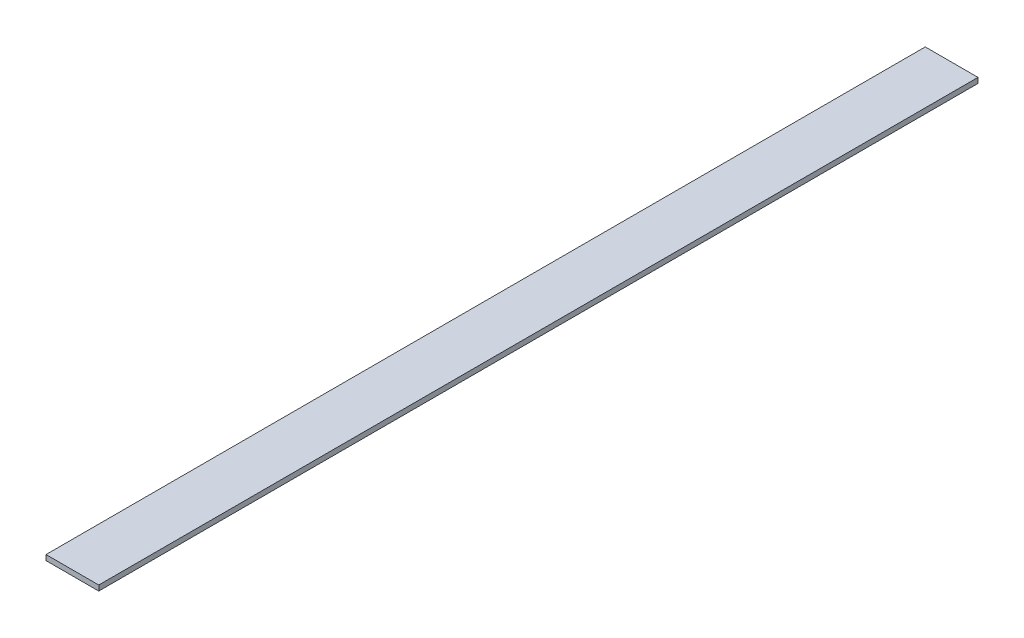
ISO-10303-21;
HEADER;
FILE_DESCRIPTION(('STEP AP214'),'2;1');
FILE_NAME('part.step','',(''),(''),'','','');
FILE_SCHEMA(('AUTOMOTIVE_DESIGN { 1 0 10303 214 1 1 1 1 }'));
ENDSEC;
DATA;
#1=APPLICATION_CONTEXT('core data for automotive mechanical design processes');
#2=APPLICATION_PROTOCOL_DEFINITION('international standard','automotive_design',2000,#1);
#3=PRODUCT_CONTEXT('',#1,'mechanical');
#4=PRODUCT('Part','Part','',(#3));
#5=PRODUCT_RELATED_PRODUCT_CATEGORY('part','',(#4));
#6=PRODUCT_DEFINITION_FORMATION('','',#4);
#7=PRODUCT_DEFINITION_CONTEXT('part definition',#1,'design');
#8=PRODUCT_DEFINITION('design','',#6,#7);
#9=PRODUCT_DEFINITION_SHAPE('','',#8);
#10=(LENGTH_UNIT() NAMED_UNIT(*) SI_UNIT(.MILLI.,.METRE.));
#11=(NAMED_UNIT(*) PLANE_ANGLE_UNIT() SI_UNIT($,.RADIAN.));
#12=(NAMED_UNIT(*) SI_UNIT($,.STERADIAN.) SOLID_ANGLE_UNIT());
#13=UNCERTAINTY_MEASURE_WITH_UNIT(LENGTH_MEASURE(1.E-05),#10,'distance_accuracy_value','');
#14=(GEOMETRIC_REPRESENTATION_CONTEXT(3) GLOBAL_UNCERTAINTY_ASSIGNED_CONTEXT((#13)) GLOBAL_UNIT_ASSIGNED_CONTEXT((#10,
#11,#12)) REPRESENTATION_CONTEXT('',''));
#15=CARTESIAN_POINT('',(0.,0.,0.));
#16=DIRECTION('',(0.,0.,1.));
#17=DIRECTION('',(1.,0.,0.));
#18=AXIS2_PLACEMENT_3D('',#15,#16,#17);
#19=CARTESIAN_POINT('',(15.,0.,0.));
#20=DIRECTION('',(-1.,0.,0.));
#21=DIRECTION('',(0.,0.,1.));
#22=AXIS2_PLACEMENT_3D('',#19,#20,#21);
#23=PLANE('',#22);
#24=DIRECTION('',(0.,-1.,0.));
#25=VECTOR('',#24,1.);
#26=CARTESIAN_POINT('',(15.,1.5,0.));
#27=LINE('',#26,#25);
#28=CARTESIAN_POINT('',(15.,3.,0.));
#29=VERTEX_POINT('',#28);
#30=CARTESIAN_POINT('',(15.,0.,0.));
#31=VERTEX_POINT('',#30);
#32=EDGE_CURVE('E51',#29,#31,#27,.T.);
#33=ORIENTED_EDGE('',*,*,#32,.F.);
#34=DIRECTION('',(0.,0.,-1.));
#35=VECTOR('',#34,1.);
#36=CARTESIAN_POINT('',(15.,3.,250.));
#37=LINE('',#36,#35);
#38=CARTESIAN_POINT('',(15.,3.,500.));
#39=VERTEX_POINT('',#38);
#40=EDGE_CURVE('E66',#39,#29,#37,.T.);
#41=ORIENTED_EDGE('',*,*,#40,.F.);
#42=DIRECTION('',(0.,-1.,0.));
#43=VECTOR('',#42,1.);
#44=CARTESIAN_POINT('',(15.,1.5,500.));
#45=LINE('',#44,#43);
#46=CARTESIAN_POINT('',(15.,0.,500.));
#47=VERTEX_POINT('',#46);
#48=EDGE_CURVE('E18',#39,#47,#45,.T.);
#49=ORIENTED_EDGE('',*,*,#48,.T.);
#50=DIRECTION('',(0.,0.,1.));
#51=VECTOR('',#50,1.);
#52=CARTESIAN_POINT('',(15.,0.,250.));
#53=LINE('',#52,#51);
#54=EDGE_CURVE('E56',#31,#47,#53,.T.);
#55=ORIENTED_EDGE('',*,*,#54,.F.);
#56=EDGE_LOOP('',(#33,#41,#49,#55));
#57=FACE_BOUND('',#56,.T.);
#58=ADVANCED_FACE('F14',(#57),#23,.F.);
#59=CARTESIAN_POINT('',(15.,0.,500.));
#60=DIRECTION('',(0.,0.,-1.));
#61=DIRECTION('',(-1.,0.,0.));
#62=AXIS2_PLACEMENT_3D('',#59,#60,#61);
#63=PLANE('',#62);
#64=DIRECTION('',(-1.,0.,0.));
#65=VECTOR('',#64,1.);
#66=CARTESIAN_POINT('',(0.,0.,500.));
#67=LINE('',#66,#65);
#68=CARTESIAN_POINT('',(-15.,0.,500.));
#69=VERTEX_POINT('',#68);
#70=EDGE_CURVE('E61',#47,#69,#67,.T.);
#71=ORIENTED_EDGE('',*,*,#70,.F.);
#72=ORIENTED_EDGE('',*,*,#48,.F.);
#73=DIRECTION('',(1.,0.,0.));
#74=VECTOR('',#73,1.);
#75=CARTESIAN_POINT('',(0.,3.,500.));
#76=LINE('',#75,#74);
#77=CARTESIAN_POINT('',(-15.,3.,500.));
#78=VERTEX_POINT('',#77);
#79=EDGE_CURVE('E79',#78,#39,#76,.T.);
#80=ORIENTED_EDGE('',*,*,#79,.F.);
#81=DIRECTION('',(0.,-1.,0.));
#82=VECTOR('',#81,1.);
#83=CARTESIAN_POINT('',(-15.,1.5,500.));
#84=LINE('',#83,#82);
#85=EDGE_CURVE('E72',#78,#69,#84,.T.);
#86=ORIENTED_EDGE('',*,*,#85,.T.);
#87=EDGE_LOOP('',(#71,#72,#80,#86));
#88=FACE_BOUND('',#87,.T.);
#89=ADVANCED_FACE('F71',(#88),#63,.F.);
#90=CARTESIAN_POINT('',(-15.,0.,500.));
#91=DIRECTION('',(0.,-1.,0.));
#92=DIRECTION('',(0.,0.,-1.));
#93=AXIS2_PLACEMENT_3D('',#90,#91,#92);
#94=PLANE('',#93);
#95=ORIENTED_EDGE('',*,*,#70,.T.);
#96=DIRECTION('',(0.,0.,-1.));
#97=VECTOR('',#96,1.);
#98=CARTESIAN_POINT('',(-15.,0.,250.));
#99=LINE('',#98,#97);
#100=CARTESIAN_POINT('',(-15.,0.,0.));
#101=VERTEX_POINT('',#100);
#102=EDGE_CURVE('E82',#69,#101,#99,.T.);
#103=ORIENTED_EDGE('',*,*,#102,.T.);
#104=DIRECTION('',(-1.,0.,0.));
#105=VECTOR('',#104,1.);
#106=CARTESIAN_POINT('',(0.,0.,0.));
#107=LINE('',#106,#105);
#108=EDGE_CURVE('E63',#31,#101,#107,.T.);
#109=ORIENTED_EDGE('',*,*,#108,.F.);
#110=ORIENTED_EDGE('',*,*,#54,.T.);
#111=EDGE_LOOP('',(#95,#103,#109,#110));
#112=FACE_BOUND('',#111,.T.);
#113=ADVANCED_FACE('F58',(#112),#94,.T.);
#114=CARTESIAN_POINT('',(15.,0.,0.));
#115=DIRECTION('',(0.,0.,-1.));
#116=DIRECTION('',(-1.,0.,0.));
#117=AXIS2_PLACEMENT_3D('',#114,#115,#116);
#118=PLANE('',#117);
#119=ORIENTED_EDGE('',*,*,#32,.T.);
#120=ORIENTED_EDGE('',*,*,#108,.T.);
#121=DIRECTION('',(0.,1.,0.));
#122=VECTOR('',#121,1.);
#123=CARTESIAN_POINT('',(-15.,1.5,0.));
#124=LINE('',#123,#122);
#125=CARTESIAN_POINT('',(-15.,3.,0.));
#126=VERTEX_POINT('',#125);
#127=EDGE_CURVE('E24',#101,#126,#124,.T.);
#128=ORIENTED_EDGE('',*,*,#127,.T.);
#129=DIRECTION('',(-1.,0.,0.));
#130=VECTOR('',#129,1.);
#131=CARTESIAN_POINT('',(0.,3.,0.));
#132=LINE('',#131,#130);
#133=EDGE_CURVE('E32',#29,#126,#132,.T.);
#134=ORIENTED_EDGE('',*,*,#133,.F.);
#135=EDGE_LOOP('',(#119,#120,#128,#134));
#136=FACE_BOUND('',#135,.T.);
#137=ADVANCED_FACE('F86',(#136),#118,.T.);
#138=CARTESIAN_POINT('',(15.,3.,0.));
#139=DIRECTION('',(0.,1.,0.));
#140=DIRECTION('',(-1.,0.,0.));
#141=AXIS2_PLACEMENT_3D('',#138,#139,#140);
#142=PLANE('',#141);
#143=DIRECTION('',(0.,0.,1.));
#144=VECTOR('',#143,1.);
#145=CARTESIAN_POINT('',(-15.,3.,250.));
#146=LINE('',#145,#144);
#147=EDGE_CURVE('E9',#126,#78,#146,.T.);
#148=ORIENTED_EDGE('',*,*,#147,.T.);
#149=ORIENTED_EDGE('',*,*,#79,.T.);
#150=ORIENTED_EDGE('',*,*,#40,.T.);
#151=ORIENTED_EDGE('',*,*,#133,.T.);
#152=EDGE_LOOP('',(#148,#149,#150,#151));
#153=FACE_BOUND('',#152,.T.);
#154=ADVANCED_FACE('F88',(#153),#142,.T.);
#155=CARTESIAN_POINT('',(-15.,0.,500.));
#156=DIRECTION('',(1.,0.,0.));
#157=DIRECTION('',(0.,0.,-1.));
#158=AXIS2_PLACEMENT_3D('',#155,#156,#157);
#159=PLANE('',#158);
#160=ORIENTED_EDGE('',*,*,#127,.F.);
#161=ORIENTED_EDGE('',*,*,#102,.F.);
#162=ORIENTED_EDGE('',*,*,#85,.F.);
#163=ORIENTED_EDGE('',*,*,#147,.F.);
#164=EDGE_LOOP('',(#160,#161,#162,#163));
#165=FACE_BOUND('',#164,.T.);
#166=ADVANCED_FACE('F16',(#165),#159,.F.);
#167=CLOSED_SHELL('',(#58,#89,#113,#137,#154,#166));
#168=MANIFOLD_SOLID_BREP('B1',#167);
#169=ADVANCED_BREP_SHAPE_REPRESENTATION('',(#18,#168),#14);
#170=SHAPE_DEFINITION_REPRESENTATION(#9,#169);
ENDSEC;
END-ISO-10303-21;
